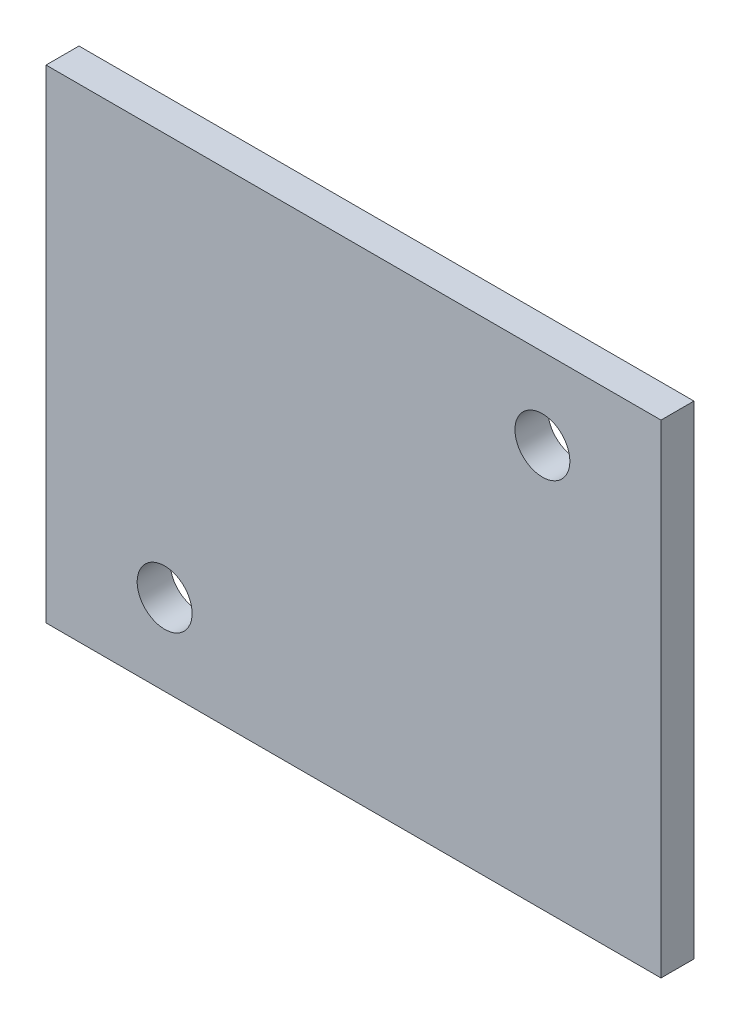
ISO-10303-21;
HEADER;
FILE_DESCRIPTION(('STEP AP214'),'2;1');
FILE_NAME('part.step','',(''),(''),'','','');
FILE_SCHEMA(('AUTOMOTIVE_DESIGN { 1 0 10303 214 1 1 1 1 }'));
ENDSEC;
DATA;
#1=APPLICATION_CONTEXT('core data for automotive mechanical design processes');
#2=APPLICATION_PROTOCOL_DEFINITION('international standard','automotive_design',2000,#1);
#3=PRODUCT_CONTEXT('',#1,'mechanical');
#4=PRODUCT('Part','Part','',(#3));
#5=PRODUCT_RELATED_PRODUCT_CATEGORY('part','',(#4));
#6=PRODUCT_DEFINITION_FORMATION('','',#4);
#7=PRODUCT_DEFINITION_CONTEXT('part definition',#1,'design');
#8=PRODUCT_DEFINITION('design','',#6,#7);
#9=PRODUCT_DEFINITION_SHAPE('','',#8);
#10=(LENGTH_UNIT() NAMED_UNIT(*) SI_UNIT(.MILLI.,.METRE.));
#11=(NAMED_UNIT(*) PLANE_ANGLE_UNIT() SI_UNIT($,.RADIAN.));
#12=(NAMED_UNIT(*) SI_UNIT($,.STERADIAN.) SOLID_ANGLE_UNIT());
#13=UNCERTAINTY_MEASURE_WITH_UNIT(LENGTH_MEASURE(1.E-05),#10,'distance_accuracy_value','');
#14=(GEOMETRIC_REPRESENTATION_CONTEXT(3) GLOBAL_UNCERTAINTY_ASSIGNED_CONTEXT((#13)) GLOBAL_UNIT_ASSIGNED_CONTEXT((#10,
#11,#12)) REPRESENTATION_CONTEXT('',''));
#15=CARTESIAN_POINT('',(0.,0.,0.));
#16=DIRECTION('',(0.,0.,1.));
#17=DIRECTION('',(1.,0.,0.));
#18=AXIS2_PLACEMENT_3D('',#15,#16,#17);
#19=CARTESIAN_POINT('',(-14.,-11.,1.5));
#20=DIRECTION('',(0.,0.,1.));
#21=DIRECTION('',(1.,0.,0.));
#22=AXIS2_PLACEMENT_3D('',#19,#20,#21);
#23=PLANE('',#22);
#24=CARTESIAN_POINT('',(-8.6,-7.3,1.5));
#25=DIRECTION('',(0.,0.,1.));
#26=DIRECTION('',(1.,0.,0.));
#27=AXIS2_PLACEMENT_3D('',#24,#25,#26);
#28=CIRCLE('',#27,1.25);
#29=CARTESIAN_POINT('',(-7.35,-7.3,1.5));
#30=VERTEX_POINT('',#29);
#31=EDGE_CURVE('E85',#30,#30,#28,.T.);
#32=ORIENTED_EDGE('',*,*,#31,.F.);
#33=EDGE_LOOP('',(#32));
#34=FACE_BOUND('',#33,.T.);
#35=DIRECTION('',(0.,-1.,0.));
#36=VECTOR('',#35,1.);
#37=CARTESIAN_POINT('',(-14.,11.,1.5));
#38=LINE('',#37,#36);
#39=CARTESIAN_POINT('',(-14.,11.,1.5));
#40=VERTEX_POINT('',#39);
#41=CARTESIAN_POINT('',(-14.,-11.,1.5));
#42=VERTEX_POINT('',#41);
#43=EDGE_CURVE('E95',#40,#42,#38,.T.);
#44=ORIENTED_EDGE('',*,*,#43,.T.);
#45=DIRECTION('',(1.,0.,0.));
#46=VECTOR('',#45,1.);
#47=CARTESIAN_POINT('',(-14.,-11.,1.5));
#48=LINE('',#47,#46);
#49=CARTESIAN_POINT('',(14.,-11.,1.5));
#50=VERTEX_POINT('',#49);
#51=EDGE_CURVE('E80',#42,#50,#48,.T.);
#52=ORIENTED_EDGE('',*,*,#51,.T.);
#53=DIRECTION('',(0.,1.,0.));
#54=VECTOR('',#53,1.);
#55=CARTESIAN_POINT('',(14.,11.,1.5));
#56=LINE('',#55,#54);
#57=CARTESIAN_POINT('',(14.,11.,1.5));
#58=VERTEX_POINT('',#57);
#59=EDGE_CURVE('E46',#50,#58,#56,.T.);
#60=ORIENTED_EDGE('',*,*,#59,.T.);
#61=DIRECTION('',(-1.,0.,0.));
#62=VECTOR('',#61,1.);
#63=CARTESIAN_POINT('',(-14.,11.,1.5));
#64=LINE('',#63,#62);
#65=EDGE_CURVE('E41',#58,#40,#64,.T.);
#66=ORIENTED_EDGE('',*,*,#65,.T.);
#67=EDGE_LOOP('',(#44,#52,#60,#66));
#68=FACE_BOUND('',#67,.T.);
#69=CARTESIAN_POINT('',(8.6,7.3,1.5));
#70=DIRECTION('',(0.,0.,1.));
#71=DIRECTION('',(1.,0.,0.));
#72=AXIS2_PLACEMENT_3D('',#69,#70,#71);
#73=CIRCLE('',#72,1.25);
#74=CARTESIAN_POINT('',(9.85,7.3,1.5));
#75=VERTEX_POINT('',#74);
#76=EDGE_CURVE('E113',#75,#75,#73,.T.);
#77=ORIENTED_EDGE('',*,*,#76,.F.);
#78=EDGE_LOOP('',(#77));
#79=FACE_BOUND('',#78,.T.);
#80=ADVANCED_FACE('F26',(#34,#68,#79),#23,.T.);
#81=CARTESIAN_POINT('',(-14.,-11.,0.));
#82=DIRECTION('',(0.,0.,1.));
#83=DIRECTION('',(1.,0.,0.));
#84=AXIS2_PLACEMENT_3D('',#81,#82,#83);
#85=PLANE('',#84);
#86=CARTESIAN_POINT('',(-8.6,-7.3,0.));
#87=DIRECTION('',(0.,0.,1.));
#88=DIRECTION('',(1.,0.,0.));
#89=AXIS2_PLACEMENT_3D('',#86,#87,#88);
#90=CIRCLE('',#89,1.25);
#91=CARTESIAN_POINT('',(-7.35,-7.3,0.));
#92=VERTEX_POINT('',#91);
#93=EDGE_CURVE('E88',#92,#92,#90,.T.);
#94=ORIENTED_EDGE('',*,*,#93,.T.);
#95=EDGE_LOOP('',(#94));
#96=FACE_BOUND('',#95,.T.);
#97=DIRECTION('',(0.,-1.,0.));
#98=VECTOR('',#97,1.);
#99=CARTESIAN_POINT('',(-14.,11.,0.));
#100=LINE('',#99,#98);
#101=CARTESIAN_POINT('',(-14.,11.,0.));
#102=VERTEX_POINT('',#101);
#103=CARTESIAN_POINT('',(-14.,-11.,0.));
#104=VERTEX_POINT('',#103);
#105=EDGE_CURVE('E72',#102,#104,#100,.T.);
#106=ORIENTED_EDGE('',*,*,#105,.F.);
#107=DIRECTION('',(-1.,0.,0.));
#108=VECTOR('',#107,1.);
#109=CARTESIAN_POINT('',(-14.,11.,0.));
#110=LINE('',#109,#108);
#111=CARTESIAN_POINT('',(14.,11.,0.));
#112=VERTEX_POINT('',#111);
#113=EDGE_CURVE('E93',#112,#102,#110,.T.);
#114=ORIENTED_EDGE('',*,*,#113,.F.);
#115=DIRECTION('',(0.,1.,0.));
#116=VECTOR('',#115,1.);
#117=CARTESIAN_POINT('',(14.,11.,0.));
#118=LINE('',#117,#116);
#119=CARTESIAN_POINT('',(14.,-11.,0.));
#120=VERTEX_POINT('',#119);
#121=EDGE_CURVE('E73',#120,#112,#118,.T.);
#122=ORIENTED_EDGE('',*,*,#121,.F.);
#123=DIRECTION('',(1.,0.,0.));
#124=VECTOR('',#123,1.);
#125=CARTESIAN_POINT('',(-14.,-11.,0.));
#126=LINE('',#125,#124);
#127=EDGE_CURVE('E67',#104,#120,#126,.T.);
#128=ORIENTED_EDGE('',*,*,#127,.F.);
#129=EDGE_LOOP('',(#106,#114,#122,#128));
#130=FACE_BOUND('',#129,.T.);
#131=CARTESIAN_POINT('',(8.6,7.3,0.));
#132=DIRECTION('',(0.,0.,1.));
#133=DIRECTION('',(1.,0.,0.));
#134=AXIS2_PLACEMENT_3D('',#131,#132,#133);
#135=CIRCLE('',#134,1.25);
#136=CARTESIAN_POINT('',(9.85,7.3,0.));
#137=VERTEX_POINT('',#136);
#138=EDGE_CURVE('E115',#137,#137,#135,.T.);
#139=ORIENTED_EDGE('',*,*,#138,.T.);
#140=EDGE_LOOP('',(#139));
#141=FACE_BOUND('',#140,.T.);
#142=ADVANCED_FACE('F68',(#96,#130,#141),#85,.F.);
#143=CARTESIAN_POINT('',(-14.,11.,1.5));
#144=DIRECTION('',(1.,0.,0.));
#145=DIRECTION('',(0.,1.,0.));
#146=AXIS2_PLACEMENT_3D('',#143,#144,#145);
#147=PLANE('',#146);
#148=ORIENTED_EDGE('',*,*,#105,.T.);
#149=DIRECTION('',(0.,0.,-1.));
#150=VECTOR('',#149,1.);
#151=CARTESIAN_POINT('',(-14.,-11.,1.5));
#152=LINE('',#151,#150);
#153=EDGE_CURVE('E11',#42,#104,#152,.T.);
#154=ORIENTED_EDGE('',*,*,#153,.F.);
#155=ORIENTED_EDGE('',*,*,#43,.F.);
#156=DIRECTION('',(0.,0.,-1.));
#157=VECTOR('',#156,1.);
#158=CARTESIAN_POINT('',(-14.,11.,1.5));
#159=LINE('',#158,#157);
#160=EDGE_CURVE('E84',#40,#102,#159,.T.);
#161=ORIENTED_EDGE('',*,*,#160,.T.);
#162=EDGE_LOOP('',(#148,#154,#155,#161));
#163=FACE_BOUND('',#162,.T.);
#164=ADVANCED_FACE('F28',(#163),#147,.F.);
#165=CARTESIAN_POINT('',(-14.,-11.,1.5));
#166=DIRECTION('',(0.,1.,0.));
#167=DIRECTION('',(0.,0.,1.));
#168=AXIS2_PLACEMENT_3D('',#165,#166,#167);
#169=PLANE('',#168);
#170=ORIENTED_EDGE('',*,*,#127,.T.);
#171=DIRECTION('',(0.,0.,-1.));
#172=VECTOR('',#171,1.);
#173=CARTESIAN_POINT('',(14.,-11.,1.5));
#174=LINE('',#173,#172);
#175=EDGE_CURVE('E34',#50,#120,#174,.T.);
#176=ORIENTED_EDGE('',*,*,#175,.F.);
#177=ORIENTED_EDGE('',*,*,#51,.F.);
#178=ORIENTED_EDGE('',*,*,#153,.T.);
#179=EDGE_LOOP('',(#170,#176,#177,#178));
#180=FACE_BOUND('',#179,.T.);
#181=ADVANCED_FACE('F79',(#180),#169,.F.);
#182=CARTESIAN_POINT('',(14.,11.,1.5));
#183=DIRECTION('',(-1.,0.,0.));
#184=DIRECTION('',(0.,-1.,0.));
#185=AXIS2_PLACEMENT_3D('',#182,#183,#184);
#186=PLANE('',#185);
#187=ORIENTED_EDGE('',*,*,#121,.T.);
#188=DIRECTION('',(0.,0.,-1.));
#189=VECTOR('',#188,1.);
#190=CARTESIAN_POINT('',(14.,11.,1.5));
#191=LINE('',#190,#189);
#192=EDGE_CURVE('E101',#58,#112,#191,.T.);
#193=ORIENTED_EDGE('',*,*,#192,.F.);
#194=ORIENTED_EDGE('',*,*,#59,.F.);
#195=ORIENTED_EDGE('',*,*,#175,.T.);
#196=EDGE_LOOP('',(#187,#193,#194,#195));
#197=FACE_BOUND('',#196,.T.);
#198=ADVANCED_FACE('F104',(#197),#186,.F.);
#199=CARTESIAN_POINT('',(-14.,11.,1.5));
#200=DIRECTION('',(0.,-1.,0.));
#201=DIRECTION('',(0.,0.,-1.));
#202=AXIS2_PLACEMENT_3D('',#199,#200,#201);
#203=PLANE('',#202);
#204=ORIENTED_EDGE('',*,*,#113,.T.);
#205=ORIENTED_EDGE('',*,*,#160,.F.);
#206=ORIENTED_EDGE('',*,*,#65,.F.);
#207=ORIENTED_EDGE('',*,*,#192,.T.);
#208=EDGE_LOOP('',(#204,#205,#206,#207));
#209=FACE_BOUND('',#208,.T.);
#210=ADVANCED_FACE('F106',(#209),#203,.F.);
#211=CARTESIAN_POINT('',(-8.6,-7.3,1.5));
#212=DIRECTION('',(0.,0.,-1.));
#213=DIRECTION('',(-1.,0.,0.));
#214=AXIS2_PLACEMENT_3D('',#211,#212,#213);
#215=CYLINDRICAL_SURFACE('',#214,1.25);
#216=ORIENTED_EDGE('',*,*,#31,.T.);
#217=EDGE_LOOP('',(#216));
#218=FACE_BOUND('',#217,.T.);
#219=ORIENTED_EDGE('',*,*,#93,.F.);
#220=EDGE_LOOP('',(#219));
#221=FACE_BOUND('',#220,.T.);
#222=ADVANCED_FACE('F124',(#218,#221),#215,.F.);
#223=CARTESIAN_POINT('',(8.6,7.3,1.5));
#224=DIRECTION('',(0.,0.,-1.));
#225=DIRECTION('',(-1.,0.,0.));
#226=AXIS2_PLACEMENT_3D('',#223,#224,#225);
#227=CYLINDRICAL_SURFACE('',#226,1.25);
#228=ORIENTED_EDGE('',*,*,#76,.T.);
#229=EDGE_LOOP('',(#228));
#230=FACE_BOUND('',#229,.T.);
#231=ORIENTED_EDGE('',*,*,#138,.F.);
#232=EDGE_LOOP('',(#231));
#233=FACE_BOUND('',#232,.T.);
#234=ADVANCED_FACE('F122',(#230,#233),#227,.F.);
#235=CLOSED_SHELL('',(#80,#142,#164,#181,#198,#210,#222,#234));
#236=MANIFOLD_SOLID_BREP('B2',#235);
#237=ADVANCED_BREP_SHAPE_REPRESENTATION('',(#18,#236),#14);
#238=SHAPE_DEFINITION_REPRESENTATION(#9,#237);
ENDSEC;
END-ISO-10303-21;
